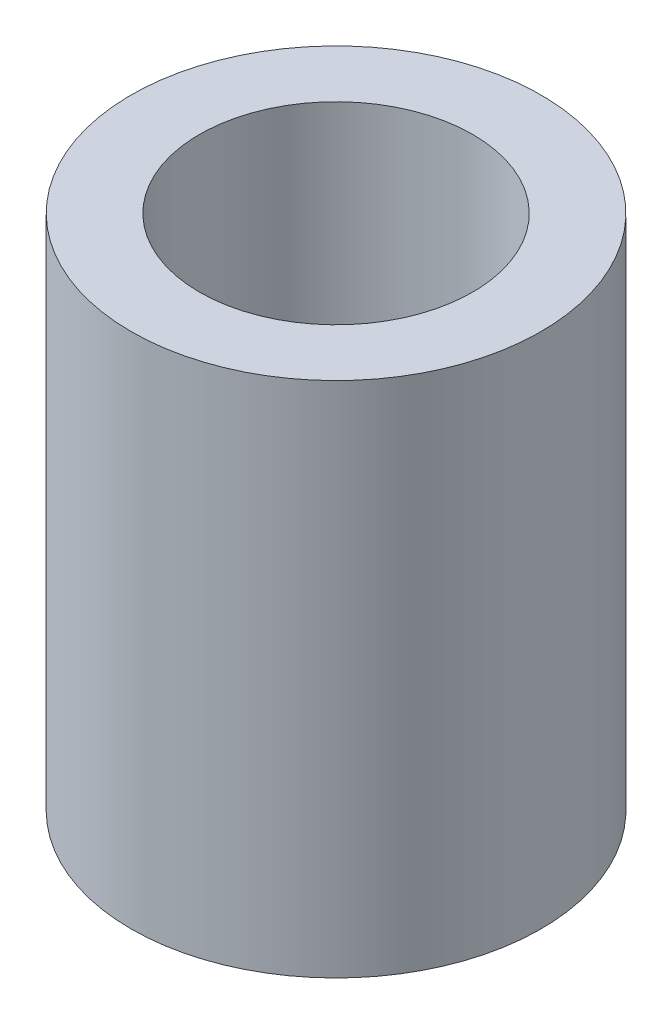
from build123d import *

# Parameters (mm, degrees)
BASE_EXTRUSION_DEPTH      = 54.6
BASE_EXTRUSION_DEPTH_BACK = 59
ESQUISSE1_R               = 45
ESQUISSE1_R_2             = 30


with BuildPart() as part:
    # Esquisse1 → Base-Extrusion (new, two sides: drawn at the far end of the back side and taken through both)
    with BuildSketch(Plane(origin=(0, 0, 0), x_dir=(1, 0, 0), z_dir=(0, 1, 0)).offset(-BASE_EXTRUSION_DEPTH_BACK)):
        with Locations(Location((0, 0, 0), (0, 0, 270))):
            Circle(ESQUISSE1_R)
        with Locations(Location((0, 0, 0), (0, 0, 270))):
            Circle(ESQUISSE1_R_2, mode=Mode.SUBTRACT)
    extrude(amount=BASE_EXTRUSION_DEPTH + BASE_EXTRUSION_DEPTH_BACK)


solid = part.part
